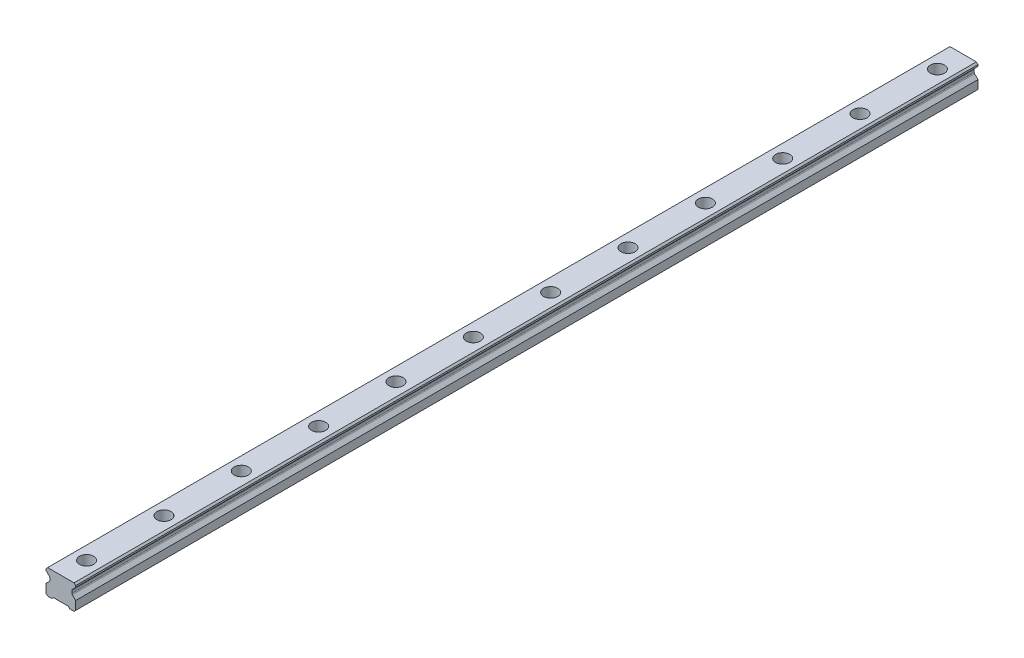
from build123d import *

# Parameters (mm, degrees)
SKETCH1_W           = 23
SKETCH1_H           = 19.2
BOSS_EXTRUDE1_DEPTH = 350
CUT_EXTRUDE1_DEPTH  = 701.357687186
CHAMFER1_SIZE       = 1.25
FILLET1_R           = 1.25
CUT_EXTRUDE2_DEPTH  = 701.357687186
SKETCH4_R           = 5.5
SKETCH4_R_2         = 3.5
CUT_EXTRUDE3_DEPTH  = 9
SKETCH4_2_R         = 3.5
CUT_EXTRUDE4_DEPTH  = 351.714827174
LPATTERN1_COUNT     = 12
LPATTERN1_PITCH     = 60


with BuildPart() as part:
    # Sketch1 → Boss-Extrude1 (new, symmetric)
    with BuildSketch(Plane.XY):
        with Locations((0, 9.6)):
            Rectangle(SKETCH1_W, SKETCH1_H)
    extrude(amount=BOSS_EXTRUDE1_DEPTH, both=True)

    # Sketch2 → Cut-Extrude1 (cut, through all)
    with BuildSketch(Plane.XY.offset(350)):
        Polygon((-11.5, 16.7), (-11.5, 7.95), (-8.583333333, 10.866666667), (-8.583333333, 13.783333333), align=None)
        Polygon((8.583333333, 13.783333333), (11.5, 16.7), (11.5, 7.95), (8.583333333, 10.866666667), align=None)
    extrude(amount=-CUT_EXTRUDE1_DEPTH, mode=Mode.SUBTRACT)

    # Chamfer1
    chamfer1_edges = [part.edges().sort_by_distance(p)[0] for p in [
        (-11.5, 19.2, 0),
        (11.5, 19.2, 0),
        (11.5, 0, 0),
        (-11.5, 0, 0),
    ]]
    chamfer(chamfer1_edges, length=CHAMFER1_SIZE)

    # Fillet1
    fillet1_edges = [part.edges().sort_by_distance(p)[0] for p in [
        (-8.583333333, 13.783333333, 0),
        (-8.583333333, 10.866666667, 0),
        (8.583333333, 10.866666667, 0),
        (8.583333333, 13.783333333, 0),
    ]]
    fillet(fillet1_edges, radius=FILLET1_R)

    # Sketch3 → Cut-Extrude2 (cut, through all)
    with BuildSketch(Plane.XY.offset(350)):
        Polygon((-7, 0), (-5.75, 1.25), (5.75, 1.25), (7, 0), align=None)
    extrude(amount=-CUT_EXTRUDE2_DEPTH, mode=Mode.SUBTRACT)

    # Sketch4 → Cut-Extrude3 (cut)
    with BuildSketch(Plane(origin=(0, 19.2, 0), x_dir=(1, 0, 0), z_dir=(0, 1, 0))):
        with Locations(Location((0, -330, 0), (0, 0, 270))):
            Circle(SKETCH4_R)
        with Locations(Location((0, -330, 0), (0, 0, 270))):
            Circle(SKETCH4_R_2, mode=Mode.SUBTRACT)
    cut_extrude3 = extrude(amount=-CUT_EXTRUDE3_DEPTH, mode=Mode.SUBTRACT)

    # Sketch4_2 → Cut-Extrude4 (cut, through all)
    with BuildSketch(Plane(origin=(0, 19.2, 0), x_dir=(1, 0, 0), z_dir=(0, 1, 0))):
        with Locations(Location((0, -330, 0), (0, 0, 270))):
            Circle(SKETCH4_2_R)
    cut_extrude4 = extrude(amount=-CUT_EXTRUDE4_DEPTH, mode=Mode.SUBTRACT)

    # LPattern1: Cut-Extrude3, Cut-Extrude4 ×12
    with Locations(*[(0, 0, -i * LPATTERN1_PITCH) for i in range(1, LPATTERN1_COUNT)]):
        add(cut_extrude3, mode=Mode.SUBTRACT)
        add(cut_extrude4, mode=Mode.SUBTRACT)


solid = part.part
